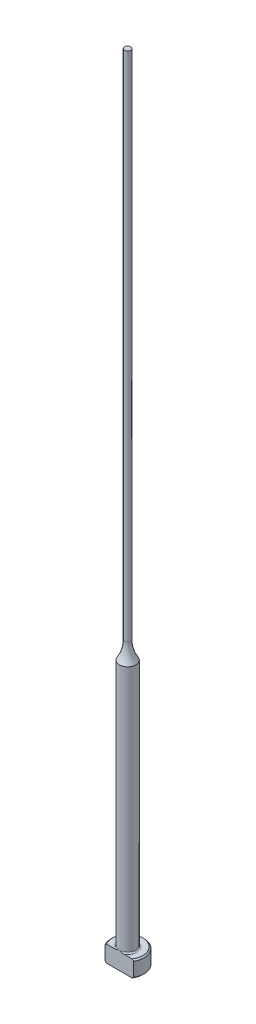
from build123d import *

# Parameters (mm, degrees)
CHAMFER1_SIZE      = 0.254
FILLET1_R          = 0.254
CUT_EXTRUDE1_DEPTH = 153.466131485


with BuildPart() as part:
    # Sketch1 → Revolve1 (revolve)
    with BuildSketch(Plane.XY, mode=Mode.PRIVATE) as revolve1_sk:
        with BuildLine():
            Line((0, 0), (-3.175, 0))
            Line((-3.175, 0), (-3.175, 3.175))
            Line((-3.175, 3.175), (-1.5875, 3.175))
            Line((-1.5875, 3.175), (-1.5875, 50.8))
            ThreePointArc((-1.5875, 50.8), (-0.847698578, 52.434042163), (-0.59436, 54.209772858))
            Line((-0.59436, 54.209772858), (-0.59436, 152.4))
            Line((-0.59436, 152.4), (0, 152.4))
            Line((0, 152.4), (0, 0))
        make_face()
    revolve(revolve1_sk.sketch.rotate(Axis((0, 259.958771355, 0), (0, -1, 0)), 270), axis=Axis((0, 259.958771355, 0), (0, -1, 0)))

    # Chamfer1
    chamfer1_edges = [part.edges().sort_by_distance(p)[0] for p in [
        (0, 0, -3.175),
        (0, 3.175, -3.175),
    ]]
    chamfer(chamfer1_edges, length=CHAMFER1_SIZE)

    # Fillet1
    fillet1_edges = [part.edges().sort_by_distance(p)[0] for p in [
        (0, 3.175, -1.5875),
    ]]
    fillet(fillet1_edges, radius=FILLET1_R)

    # Sketch2 → Cut-Extrude1 (cut, through all)
    with BuildSketch(Plane.XZ):
        with BuildLine():
            Line((-2.749630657, 1.5875), (2.749630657, 1.5875))
            ThreePointArc((2.749630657, 1.5875), (0, 3.175), (-2.749630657, 1.5875))
        make_face()
    extrude(amount=-CUT_EXTRUDE1_DEPTH, mode=Mode.SUBTRACT)


solid = part.part
